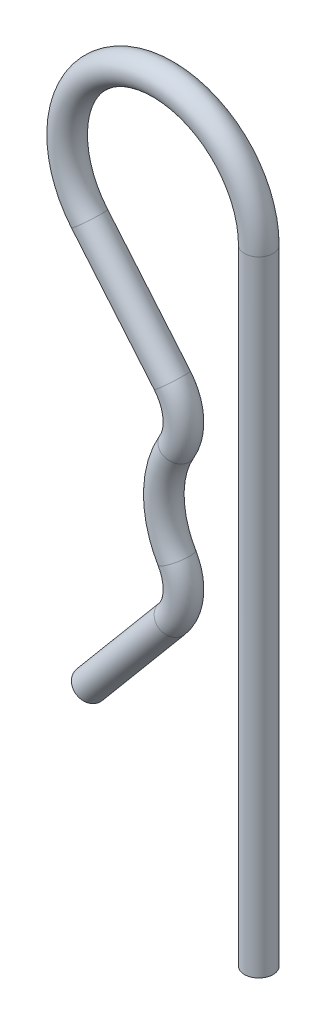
from build123d import *

# Parameters (mm, degrees)
ESQUISSE2_R = 0.9


with BuildPart() as part:
    # Base-Balayage: sweep along a path in Esquisse4
    with BuildLine(Plane.XY) as base_balayage_path:
        Line((0, -22.607501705), (0, 16.492498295))
        ThreePointArc((0, 16.492498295), (-8.051282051, 22.13095925), (-10.597413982, 12.637140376))
        Line((-10.597413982, 12.637140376), (-5.418210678, 6.461075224))
        ThreePointArc((-5.418210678, 6.461075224), (-4.727330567, 4.783134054), (-5.130241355, 3.013822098))
        ThreePointArc((-5.130241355, 3.013822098), (-5.95, 0), (-5.130241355, -3.013822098))
        ThreePointArc((-5.130241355, -3.013822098), (-4.727330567, -4.783134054), (-5.418210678, -6.461075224))
        Line((-5.418210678, -6.461075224), (-10.597413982, -12.637140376))
    # Esquisse2 → Base-Balayage (sweep)
    with BuildSketch(Plane(origin=(0, -22.607501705, 0), x_dir=(1, 0, 0), z_dir=(0, 1, 0))):
        Circle(ESQUISSE2_R)
    sweep(path=base_balayage_path.line)


solid = part.part
